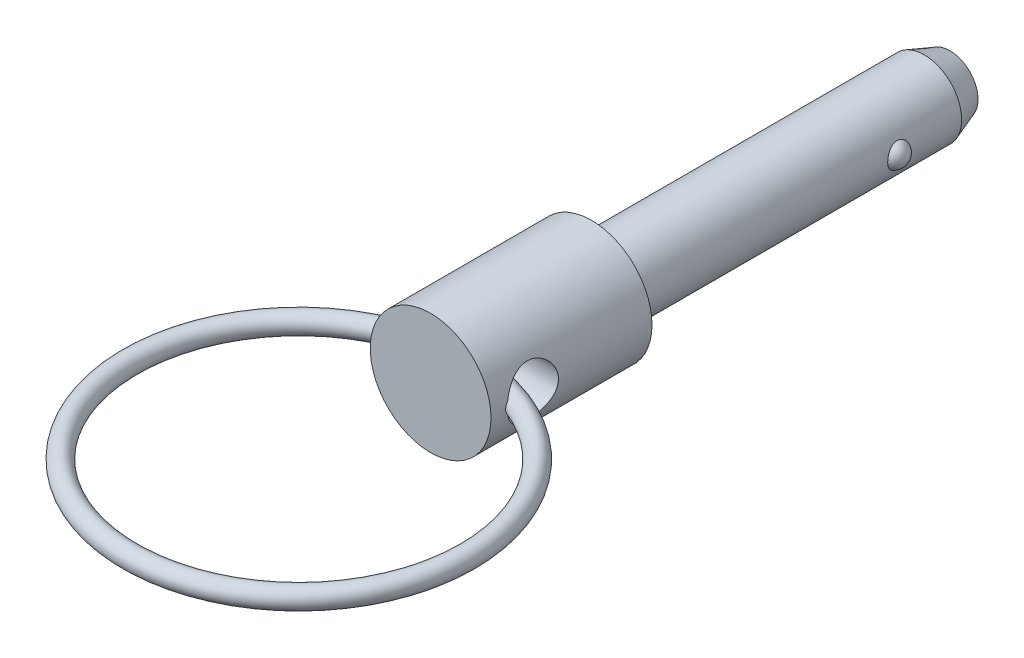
ISO-10303-21;
HEADER;
FILE_DESCRIPTION(('STEP AP214'),'2;1');
FILE_NAME('part.step','',(''),(''),'','','');
FILE_SCHEMA(('AUTOMOTIVE_DESIGN { 1 0 10303 214 1 1 1 1 }'));
ENDSEC;
DATA;
#1=APPLICATION_CONTEXT('core data for automotive mechanical design processes');
#2=APPLICATION_PROTOCOL_DEFINITION('international standard','automotive_design',2000,#1);
#3=PRODUCT_CONTEXT('',#1,'mechanical');
#4=PRODUCT('Part','Part','',(#3));
#5=PRODUCT_RELATED_PRODUCT_CATEGORY('part','',(#4));
#6=PRODUCT_DEFINITION_FORMATION('','',#4);
#7=PRODUCT_DEFINITION_CONTEXT('part definition',#1,'design');
#8=PRODUCT_DEFINITION('design','',#6,#7);
#9=PRODUCT_DEFINITION_SHAPE('','',#8);
#10=(LENGTH_UNIT() NAMED_UNIT(*) SI_UNIT(.MILLI.,.METRE.));
#11=(NAMED_UNIT(*) PLANE_ANGLE_UNIT() SI_UNIT($,.RADIAN.));
#12=(NAMED_UNIT(*) SI_UNIT($,.STERADIAN.) SOLID_ANGLE_UNIT());
#13=UNCERTAINTY_MEASURE_WITH_UNIT(LENGTH_MEASURE(1.E-05),#10,'distance_accuracy_value','');
#14=(GEOMETRIC_REPRESENTATION_CONTEXT(3) GLOBAL_UNCERTAINTY_ASSIGNED_CONTEXT((#13)) GLOBAL_UNIT_ASSIGNED_CONTEXT((#10,
#11,#12)) REPRESENTATION_CONTEXT('',''));
#15=CARTESIAN_POINT('',(0.,0.,0.));
#16=DIRECTION('',(0.,0.,1.));
#17=DIRECTION('',(1.,0.,0.));
#18=AXIS2_PLACEMENT_3D('',#15,#16,#17);
#19=CARTESIAN_POINT('',(6.35,0.,9.398));
#20=DIRECTION('',(-1.,0.,0.));
#21=DIRECTION('',(0.,0.,-1.));
#22=AXIS2_PLACEMENT_3D('',#19,#20,#21);
#23=CYLINDRICAL_SURFACE('',#22,2.0193);
#24=CARTESIAN_POINT('',(-4.76270000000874,0.498153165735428,11.3548893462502));
#25=CARTESIAN_POINT('',(-4.72833190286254,0.475048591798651,11.3607446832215));
#26=CARTESIAN_POINT('',(-4.69505034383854,0.44991978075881,11.3667299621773));
#27=CARTESIAN_POINT('',(-4.63192457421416,0.394832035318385,11.3785339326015));
#28=CARTESIAN_POINT('',(-4.60213511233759,0.364810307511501,11.3843491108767));
#29=CARTESIAN_POINT('',(-4.55535458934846,0.308281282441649,11.3937756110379));
#30=CARTESIAN_POINT('',(-4.53705372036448,0.282907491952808,11.3975656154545));
#31=CARTESIAN_POINT('',(-4.50470768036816,0.229597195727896,11.4043835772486));
#32=CARTESIAN_POINT('',(-4.49064226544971,0.201673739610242,11.4074151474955));
#33=CARTESIAN_POINT('',(-4.46975490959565,0.148629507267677,11.4119668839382));
#34=CARTESIAN_POINT('',(-4.46210314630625,0.123852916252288,11.413657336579));
#35=CARTESIAN_POINT('',(-4.45097170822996,0.0733134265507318,11.4161269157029));
#36=CARTESIAN_POINT('',(-4.44749221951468,0.0475504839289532,11.4169060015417));
#37=CARTESIAN_POINT('',(-4.44500621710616,-0.0042594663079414,11.4174619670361));
#38=CARTESIAN_POINT('',(-4.44600914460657,-0.0303069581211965,11.4172367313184));
#39=CARTESIAN_POINT('',(-4.45241947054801,-0.0818207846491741,11.4158064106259));
#40=CARTESIAN_POINT('',(-4.45782777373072,-0.107286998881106,11.414601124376));
#41=CARTESIAN_POINT('',(-4.47240849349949,-0.156294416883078,11.4113883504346));
#42=CARTESIAN_POINT('',(-4.48147591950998,-0.179868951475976,11.4094032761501));
#43=CARTESIAN_POINT('',(-4.50279050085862,-0.225454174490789,11.404805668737));
#44=CARTESIAN_POINT('',(-4.51503925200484,-0.247464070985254,11.4021928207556));
#45=CARTESIAN_POINT('',(-4.55011891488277,-0.302206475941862,11.394845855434));
#46=CARTESIAN_POINT('',(-4.57493397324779,-0.333621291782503,11.3897686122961));
#47=CARTESIAN_POINT('',(-4.62912866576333,-0.392111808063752,11.3790894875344));
#48=CARTESIAN_POINT('',(-4.65852008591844,-0.419175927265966,11.3734862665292));
#49=CARTESIAN_POINT('',(-4.71307862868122,-0.463335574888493,11.3635175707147));
#50=CARTESIAN_POINT('',(-4.73757440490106,-0.481267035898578,11.3591766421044));
#51=CARTESIAN_POINT('',(-4.76270000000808,-0.498153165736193,11.35488934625));
#52=B_SPLINE_CURVE_WITH_KNOTS('',3,(#24,#25,#26,#27,#28,#29,#30,#31,#32,#33,#34,#35,#36,#37,#38,
#39,#40,#41,#42,#43,#44,#45,#46,#47,#48,#49,#50,#51),.UNSPECIFIED.,.F.,.F.,(4,2,2,2,2,2,2,2,2,2,
2,2,2,4),(0.,0.125801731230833,0.253367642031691,0.347579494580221,0.441333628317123,
0.518959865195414,0.596589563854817,0.674382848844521,0.75219211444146,0.827911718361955,
0.903669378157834,1.02403641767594,1.14471874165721,1.23653238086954),.UNSPECIFIED.);
#53=CARTESIAN_POINT('',(-4.73813099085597,0.481166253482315,11.3591352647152));
#54=VERTEX_POINT('',#53);
#55=CARTESIAN_POINT('',(-4.73813099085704,-0.48116625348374,11.359135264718));
#56=VERTEX_POINT('',#55);
#57=EDGE_CURVE('E40',#54,#56,#52,.T.);
#58=ORIENTED_EDGE('',*,*,#57,.F.);
#59=CARTESIAN_POINT('',(-4.7625,0.,11.4173));
#60=CARTESIAN_POINT('',(-4.76249489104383,-0.108112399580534,11.4172937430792));
#61=CARTESIAN_POINT('',(-4.75878025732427,-0.216312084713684,11.4085747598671));
#62=CARTESIAN_POINT('',(-4.74429807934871,-0.429541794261,11.3740482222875));
#63=CARTESIAN_POINT('',(-4.73352107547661,-0.534567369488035,11.3482177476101));
#64=CARTESIAN_POINT('',(-4.70606638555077,-0.73815162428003,11.280597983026));
#65=CARTESIAN_POINT('',(-4.68940628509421,-0.836728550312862,11.238856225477));
#66=CARTESIAN_POINT('',(-4.65179514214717,-1.02541561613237,11.1408163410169));
#67=CARTESIAN_POINT('',(-4.63084399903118,-1.11552555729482,11.0845178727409));
#68=CARTESIAN_POINT('',(-4.58553515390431,-1.28946876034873,10.9559107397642));
#69=CARTESIAN_POINT('',(-4.5610635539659,-1.37280723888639,10.8829734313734));
#70=CARTESIAN_POINT('',(-4.51195602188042,-1.52649281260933,10.7244940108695));
#71=CARTESIAN_POINT('',(-4.48732001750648,-1.59683374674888,10.638945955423));
#72=CARTESIAN_POINT('',(-4.43925108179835,-1.7261116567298,10.4523438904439));
#73=CARTESIAN_POINT('',(-4.41594507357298,-1.78427664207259,10.3507188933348));
#74=CARTESIAN_POINT('',(-4.37499469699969,-1.88246618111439,10.1379969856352));
#75=CARTESIAN_POINT('',(-4.35734737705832,-1.92250019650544,10.0269050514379));
#76=CARTESIAN_POINT('',(-4.33095312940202,-1.98122376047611,9.80411364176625));
#77=CARTESIAN_POINT('',(-4.32180970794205,-2.0008697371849,9.69271508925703));
#78=CARTESIAN_POINT('',(-4.31232297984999,-2.02124136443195,9.46785625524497));
#79=CARTESIAN_POINT('',(-4.31197457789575,-2.02197796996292,9.35439720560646));
#80=CARTESIAN_POINT('',(-4.31978298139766,-2.00522830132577,9.13832342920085));
#81=CARTESIAN_POINT('',(-4.32726229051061,-1.98919366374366,9.03556669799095));
#82=CARTESIAN_POINT('',(-4.34873498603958,-1.94179810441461,8.83436976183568));
#83=CARTESIAN_POINT('',(-4.36272967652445,-1.91043411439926,8.73593042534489));
#84=CARTESIAN_POINT('',(-4.39597564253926,-1.83265370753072,8.54363008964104));
#85=CARTESIAN_POINT('',(-4.41533413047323,-1.7859262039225,8.44991428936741));
#86=CARTESIAN_POINT('',(-4.45710273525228,-1.67896759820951,8.27128429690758));
#87=CARTESIAN_POINT('',(-4.4795139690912,-1.61873154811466,8.1863733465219));
#88=CARTESIAN_POINT('',(-4.52725353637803,-1.48026834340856,8.0199216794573));
#89=CARTESIAN_POINT('',(-4.55266534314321,-1.40092677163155,7.93932933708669));
#90=CARTESIAN_POINT('',(-4.60189767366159,-1.22958667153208,7.79224755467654));
#91=CARTESIAN_POINT('',(-4.62571737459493,-1.13758167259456,7.72576536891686));
#92=CARTESIAN_POINT('',(-4.66982369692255,-0.940529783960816,7.6073238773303));
#93=CARTESIAN_POINT('',(-4.69000583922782,-0.835212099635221,7.55577397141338));
#94=CARTESIAN_POINT('',(-4.72372878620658,-0.61641653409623,7.47153070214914));
#95=CARTESIAN_POINT('',(-4.7372827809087,-0.502955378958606,7.43879986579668));
#96=CARTESIAN_POINT('',(-4.7519215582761,-0.323662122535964,7.40374908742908));
#97=CARTESIAN_POINT('',(-4.75587275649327,-0.259363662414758,7.39437239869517));
#98=CARTESIAN_POINT('',(-4.76116348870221,-0.130053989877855,7.3818460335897));
#99=CARTESIAN_POINT('',(-4.76250307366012,-0.0650427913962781,7.3786962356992));
#100=CARTESIAN_POINT('',(-4.76249489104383,0.108112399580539,7.37870625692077));
#101=CARTESIAN_POINT('',(-4.75878025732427,0.216312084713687,7.38742524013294));
#102=CARTESIAN_POINT('',(-4.74429807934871,0.429541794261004,7.42195177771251));
#103=CARTESIAN_POINT('',(-4.7335210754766,0.53456736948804,7.44778225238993));
#104=CARTESIAN_POINT('',(-4.70606638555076,0.738151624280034,7.51540201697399));
#105=CARTESIAN_POINT('',(-4.68940628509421,0.836728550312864,7.55714377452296));
#106=CARTESIAN_POINT('',(-4.65179514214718,1.02541561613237,7.65518365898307));
#107=CARTESIAN_POINT('',(-4.63084399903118,1.11552555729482,7.71148212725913));
#108=CARTESIAN_POINT('',(-4.58553515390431,1.28946876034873,7.84008926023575));
#109=CARTESIAN_POINT('',(-4.5610635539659,1.37280723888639,7.91302656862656));
#110=CARTESIAN_POINT('',(-4.51195602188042,1.52649281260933,8.0715059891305));
#111=CARTESIAN_POINT('',(-4.48732001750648,1.59683374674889,8.15705404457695));
#112=CARTESIAN_POINT('',(-4.43925108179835,1.7261116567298,8.3436561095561));
#113=CARTESIAN_POINT('',(-4.41594507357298,1.78427664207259,8.44528110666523));
#114=CARTESIAN_POINT('',(-4.37499469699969,1.88246618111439,8.65800301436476));
#115=CARTESIAN_POINT('',(-4.35734737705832,1.92250019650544,8.76909494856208));
#116=CARTESIAN_POINT('',(-4.33095312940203,1.98122376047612,8.99188635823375));
#117=CARTESIAN_POINT('',(-4.32180970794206,2.00086973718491,9.10328491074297));
#118=CARTESIAN_POINT('',(-4.31232297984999,2.02124136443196,9.32814374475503));
#119=CARTESIAN_POINT('',(-4.31197457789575,2.02197796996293,9.44160279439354));
#120=CARTESIAN_POINT('',(-4.31978298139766,2.00522830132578,9.65767657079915));
#121=CARTESIAN_POINT('',(-4.32726229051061,1.98919366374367,9.76043330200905));
#122=CARTESIAN_POINT('',(-4.34873498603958,1.94179810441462,9.96163023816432));
#123=CARTESIAN_POINT('',(-4.36272967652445,1.91043411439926,10.0600695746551));
#124=CARTESIAN_POINT('',(-4.39597564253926,1.83265370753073,10.252369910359));
#125=CARTESIAN_POINT('',(-4.41533413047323,1.78592620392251,10.3460857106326));
#126=CARTESIAN_POINT('',(-4.45710273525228,1.67896759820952,10.5247157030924));
#127=CARTESIAN_POINT('',(-4.4795139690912,1.61873154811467,10.6096266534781));
#128=CARTESIAN_POINT('',(-4.52725353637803,1.48026834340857,10.7760783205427));
#129=CARTESIAN_POINT('',(-4.55266534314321,1.40092677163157,10.8566706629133));
#130=CARTESIAN_POINT('',(-4.60189767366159,1.22958667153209,11.0037524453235));
#131=CARTESIAN_POINT('',(-4.62571737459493,1.13758167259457,11.0702346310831));
#132=CARTESIAN_POINT('',(-4.66982369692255,0.94052978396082,11.1886761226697));
#133=CARTESIAN_POINT('',(-4.69000583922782,0.835212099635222,11.2402260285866));
#134=CARTESIAN_POINT('',(-4.72372878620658,0.616416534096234,11.3244692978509));
#135=CARTESIAN_POINT('',(-4.7372827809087,0.502955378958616,11.3572001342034));
#136=CARTESIAN_POINT('',(-4.7519215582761,0.323662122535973,11.392250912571));
#137=CARTESIAN_POINT('',(-4.75587275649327,0.259363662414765,11.4016276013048));
#138=CARTESIAN_POINT('',(-4.76116348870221,0.13005398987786,11.4141539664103));
#139=CARTESIAN_POINT('',(-4.76250307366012,0.0650427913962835,11.4173037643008));
#140=CARTESIAN_POINT('',(-4.7625,0.,11.4173));
#141=B_SPLINE_CURVE_WITH_KNOTS('',3,(#59,#60,#61,#62,#63,#64,#65,#66,#67,#68,#69,#70,#71,#72,
#73,#74,#75,#76,#77,#78,#79,#80,#81,#82,#83,#84,#85,#86,#87,#88,#89,#90,#91,#92,#93,#94,#95,#96,
#97,#98,#99,#100,#101,#102,#103,#104,#105,#106,#107,#108,#109,#110,#111,#112,#113,#114,#115,
#116,#117,#118,#119,#120,#121,#122,#123,#124,#125,#126,#127,#128,#129,#130,#131,#132,#133,#134,
#135,#136,#137,#138,#139,#140),.UNSPECIFIED.,.T.,.F.,(4,2,2,2,2,2,2,2,2,2,2,2,2,2,2,2,2,2,2,2,2,
2,2,2,2,2,2,2,2,2,2,2,2,2,2,2,2,2,2,2,4),(0.,0.324084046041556,0.648603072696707,
0.972160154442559,1.29572482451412,1.63451297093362,1.97346129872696,2.32983137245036,
2.68601525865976,3.02460962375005,3.36300782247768,3.67436181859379,3.98577815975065,
4.30393445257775,4.6222074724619,4.96838833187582,5.31474674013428,5.66985671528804,
6.02425711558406,6.21923699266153,6.41421306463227,6.73829711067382,7.06281613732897,
7.38637321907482,7.70993788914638,8.04872603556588,8.38767436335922,8.74404443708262,
9.10022832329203,9.43882268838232,9.77722088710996,10.0885748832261,10.3999912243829,
10.71814751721,11.0364205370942,11.3826013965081,11.7289598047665,12.0840697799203,
12.4384701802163,12.6334500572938,12.8284261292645),.UNSPECIFIED.);
#142=EDGE_CURVE('E54',#56,#54,#141,.T.);
#143=ORIENTED_EDGE('',*,*,#142,.F.);
#144=EDGE_LOOP('',(#58,#143));
#145=FACE_BOUND('',#144,.T.);
#146=CARTESIAN_POINT('',(4.76270000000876,-0.498153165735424,11.3548893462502));
#147=CARTESIAN_POINT('',(4.72833190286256,-0.475048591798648,11.3607446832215));
#148=CARTESIAN_POINT('',(4.69505034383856,-0.449919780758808,11.3667299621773));
#149=CARTESIAN_POINT('',(4.63192457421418,-0.394832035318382,11.3785339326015));
#150=CARTESIAN_POINT('',(4.60213511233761,-0.364810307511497,11.3843491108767));
#151=CARTESIAN_POINT('',(4.55535458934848,-0.308281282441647,11.3937756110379));
#152=CARTESIAN_POINT('',(4.5370537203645,-0.282907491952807,11.3975656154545));
#153=CARTESIAN_POINT('',(4.50470768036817,-0.229597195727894,11.4043835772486));
#154=CARTESIAN_POINT('',(4.49064226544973,-0.201673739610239,11.4074151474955));
#155=CARTESIAN_POINT('',(4.46975490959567,-0.148629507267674,11.4119668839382));
#156=CARTESIAN_POINT('',(4.46210314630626,-0.123852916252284,11.413657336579));
#157=CARTESIAN_POINT('',(4.45097170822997,-0.0733134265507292,11.4161269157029));
#158=CARTESIAN_POINT('',(4.44749221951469,-0.0475504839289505,11.4169060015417));
#159=CARTESIAN_POINT('',(4.44500621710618,0.00425946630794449,11.4174619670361));
#160=CARTESIAN_POINT('',(4.44600914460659,0.0303069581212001,11.4172367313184));
#161=CARTESIAN_POINT('',(4.45241947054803,0.0818207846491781,11.4158064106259));
#162=CARTESIAN_POINT('',(4.45782777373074,0.10728699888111,11.414601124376));
#163=CARTESIAN_POINT('',(4.47240849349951,0.156294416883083,11.4113883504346));
#164=CARTESIAN_POINT('',(4.48147591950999,0.179868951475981,11.4094032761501));
#165=CARTESIAN_POINT('',(4.50279050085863,0.225454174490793,11.404805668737));
#166=CARTESIAN_POINT('',(4.51503925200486,0.247464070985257,11.4021928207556));
#167=CARTESIAN_POINT('',(4.55011891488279,0.302206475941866,11.394845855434));
#168=CARTESIAN_POINT('',(4.57493397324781,0.333621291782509,11.3897686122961));
#169=CARTESIAN_POINT('',(4.62912866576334,0.392111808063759,11.3790894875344));
#170=CARTESIAN_POINT('',(4.65852008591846,0.419175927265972,11.3734862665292));
#171=CARTESIAN_POINT('',(4.71307862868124,0.463335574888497,11.3635175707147));
#172=CARTESIAN_POINT('',(4.73757440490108,0.481267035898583,11.3591766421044));
#173=CARTESIAN_POINT('',(4.7627000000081,0.498153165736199,11.35488934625));
#174=B_SPLINE_CURVE_WITH_KNOTS('',3,(#146,#147,#148,#149,#150,#151,#152,#153,#154,#155,#156,
#157,#158,#159,#160,#161,#162,#163,#164,#165,#166,#167,#168,#169,#170,#171,#172,#173),
.UNSPECIFIED.,.F.,.F.,(4,2,2,2,2,2,2,2,2,2,2,2,2,4),(0.,0.125801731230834,0.25336764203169,
0.34757949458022,0.441333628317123,0.518959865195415,0.596589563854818,0.674382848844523,
0.752192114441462,0.827911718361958,0.903669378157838,1.02403641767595,1.14471874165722,
1.23653238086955),.UNSPECIFIED.);
#175=CARTESIAN_POINT('',(4.73813099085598,-0.481166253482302,11.3591352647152));
#176=VERTEX_POINT('',#175);
#177=CARTESIAN_POINT('',(4.73813099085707,0.481166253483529,11.359135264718));
#178=VERTEX_POINT('',#177);
#179=EDGE_CURVE('E33',#176,#178,#174,.T.);
#180=ORIENTED_EDGE('',*,*,#179,.F.);
#181=CARTESIAN_POINT('',(4.7625,0.,7.3787));
#182=CARTESIAN_POINT('',(4.76249489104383,-0.108112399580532,7.37870625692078));
#183=CARTESIAN_POINT('',(4.75878025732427,-0.21631208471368,7.38742524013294));
#184=CARTESIAN_POINT('',(4.74429807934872,-0.429541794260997,7.4219517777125));
#185=CARTESIAN_POINT('',(4.73352107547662,-0.534567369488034,7.44778225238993));
#186=CARTESIAN_POINT('',(4.70606638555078,-0.738151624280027,7.51540201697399));
#187=CARTESIAN_POINT('',(4.68940628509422,-0.836728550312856,7.55714377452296));
#188=CARTESIAN_POINT('',(4.65179514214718,-1.02541561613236,7.65518365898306));
#189=CARTESIAN_POINT('',(4.63084399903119,-1.11552555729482,7.71148212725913));
#190=CARTESIAN_POINT('',(4.58553515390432,-1.28946876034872,7.84008926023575));
#191=CARTESIAN_POINT('',(4.56106355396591,-1.37280723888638,7.91302656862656));
#192=CARTESIAN_POINT('',(4.51195602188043,-1.52649281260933,8.0715059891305));
#193=CARTESIAN_POINT('',(4.48732001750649,-1.59683374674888,8.15705404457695));
#194=CARTESIAN_POINT('',(4.43925108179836,-1.7261116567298,8.3436561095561));
#195=CARTESIAN_POINT('',(4.41594507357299,-1.78427664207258,8.44528110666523));
#196=CARTESIAN_POINT('',(4.3749946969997,-1.88246618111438,8.65800301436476));
#197=CARTESIAN_POINT('',(4.35734737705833,-1.92250019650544,8.76909494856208));
#198=CARTESIAN_POINT('',(4.33095312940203,-1.98122376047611,8.99188635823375));
#199=CARTESIAN_POINT('',(4.32180970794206,-2.0008697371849,9.10328491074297));
#200=CARTESIAN_POINT('',(4.31232297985,-2.02124136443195,9.32814374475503));
#201=CARTESIAN_POINT('',(4.31197457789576,-2.02197796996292,9.44160279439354));
#202=CARTESIAN_POINT('',(4.31978298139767,-2.00522830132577,9.65767657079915));
#203=CARTESIAN_POINT('',(4.32726229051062,-1.98919366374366,9.76043330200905));
#204=CARTESIAN_POINT('',(4.34873498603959,-1.94179810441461,9.96163023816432));
#205=CARTESIAN_POINT('',(4.36272967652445,-1.91043411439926,10.0600695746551));
#206=CARTESIAN_POINT('',(4.39597564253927,-1.83265370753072,10.252369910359));
#207=CARTESIAN_POINT('',(4.41533413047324,-1.7859262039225,10.3460857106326));
#208=CARTESIAN_POINT('',(4.45710273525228,-1.67896759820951,10.5247157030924));
#209=CARTESIAN_POINT('',(4.47951396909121,-1.61873154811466,10.6096266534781));
#210=CARTESIAN_POINT('',(4.52725353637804,-1.48026834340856,10.7760783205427));
#211=CARTESIAN_POINT('',(4.55266534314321,-1.40092677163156,10.8566706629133));
#212=CARTESIAN_POINT('',(4.60189767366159,-1.22958667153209,11.0037524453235));
#213=CARTESIAN_POINT('',(4.62571737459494,-1.13758167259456,11.0702346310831));
#214=CARTESIAN_POINT('',(4.66982369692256,-0.94052978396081,11.1886761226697));
#215=CARTESIAN_POINT('',(4.69000583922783,-0.835212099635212,11.2402260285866));
#216=CARTESIAN_POINT('',(4.72372878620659,-0.616416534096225,11.3244692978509));
#217=CARTESIAN_POINT('',(4.73728278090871,-0.502955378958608,11.3572001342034));
#218=CARTESIAN_POINT('',(4.75192155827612,-0.323662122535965,11.3922509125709));
#219=CARTESIAN_POINT('',(4.75587275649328,-0.259363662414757,11.4016276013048));
#220=CARTESIAN_POINT('',(4.76116348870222,-0.130053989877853,11.4141539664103));
#221=CARTESIAN_POINT('',(4.76250307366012,-0.0650427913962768,11.4173037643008));
#222=CARTESIAN_POINT('',(4.76249489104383,0.108112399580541,11.4172937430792));
#223=CARTESIAN_POINT('',(4.75878025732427,0.216312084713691,11.4085747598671));
#224=CARTESIAN_POINT('',(4.74429807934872,0.429541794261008,11.3740482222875));
#225=CARTESIAN_POINT('',(4.73352107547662,0.534567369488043,11.3482177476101));
#226=CARTESIAN_POINT('',(4.70606638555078,0.738151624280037,11.280597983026));
#227=CARTESIAN_POINT('',(4.68940628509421,0.83672855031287,11.238856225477));
#228=CARTESIAN_POINT('',(4.65179514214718,1.02541561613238,11.1408163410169));
#229=CARTESIAN_POINT('',(4.63084399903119,1.11552555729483,11.0845178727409));
#230=CARTESIAN_POINT('',(4.58553515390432,1.28946876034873,10.9559107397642));
#231=CARTESIAN_POINT('',(4.56106355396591,1.3728072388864,10.8829734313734));
#232=CARTESIAN_POINT('',(4.51195602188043,1.52649281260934,10.7244940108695));
#233=CARTESIAN_POINT('',(4.48732001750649,1.59683374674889,10.638945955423));
#234=CARTESIAN_POINT('',(4.43925108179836,1.7261116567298,10.4523438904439));
#235=CARTESIAN_POINT('',(4.41594507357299,1.78427664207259,10.3507188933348));
#236=CARTESIAN_POINT('',(4.37499469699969,1.8824661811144,10.1379969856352));
#237=CARTESIAN_POINT('',(4.35734737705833,1.92250019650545,10.0269050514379));
#238=CARTESIAN_POINT('',(4.33095312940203,1.98122376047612,9.80411364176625));
#239=CARTESIAN_POINT('',(4.32180970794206,2.00086973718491,9.69271508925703));
#240=CARTESIAN_POINT('',(4.31232297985,2.02124136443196,9.46785625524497));
#241=CARTESIAN_POINT('',(4.31197457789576,2.02197796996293,9.35439720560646));
#242=CARTESIAN_POINT('',(4.31978298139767,2.00522830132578,9.13832342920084));
#243=CARTESIAN_POINT('',(4.32726229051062,1.98919366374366,9.03556669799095));
#244=CARTESIAN_POINT('',(4.34873498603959,1.94179810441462,8.83436976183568));
#245=CARTESIAN_POINT('',(4.36272967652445,1.91043411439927,8.73593042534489));
#246=CARTESIAN_POINT('',(4.39597564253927,1.83265370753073,8.54363008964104));
#247=CARTESIAN_POINT('',(4.41533413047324,1.7859262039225,8.44991428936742));
#248=CARTESIAN_POINT('',(4.45710273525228,1.67896759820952,8.27128429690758));
#249=CARTESIAN_POINT('',(4.47951396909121,1.61873154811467,8.1863733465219));
#250=CARTESIAN_POINT('',(4.52725353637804,1.48026834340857,8.0199216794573));
#251=CARTESIAN_POINT('',(4.55266534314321,1.40092677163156,7.93932933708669));
#252=CARTESIAN_POINT('',(4.6018976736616,1.22958667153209,7.79224755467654));
#253=CARTESIAN_POINT('',(4.62571737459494,1.13758167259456,7.72576536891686));
#254=CARTESIAN_POINT('',(4.66982369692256,0.940529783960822,7.6073238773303));
#255=CARTESIAN_POINT('',(4.69000583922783,0.835212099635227,7.55577397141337));
#256=CARTESIAN_POINT('',(4.72372878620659,0.616416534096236,7.47153070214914));
#257=CARTESIAN_POINT('',(4.73728278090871,0.502955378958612,7.43879986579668));
#258=CARTESIAN_POINT('',(4.75192155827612,0.32366212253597,7.40374908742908));
#259=CARTESIAN_POINT('',(4.75587275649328,0.259363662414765,7.39437239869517));
#260=CARTESIAN_POINT('',(4.76116348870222,0.130053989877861,7.3818460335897));
#261=CARTESIAN_POINT('',(4.76250307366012,0.0650427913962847,7.3786962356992));
#262=CARTESIAN_POINT('',(4.7625,0.,7.3787));
#263=B_SPLINE_CURVE_WITH_KNOTS('',3,(#181,#182,#183,#184,#185,#186,#187,#188,#189,#190,#191,
#192,#193,#194,#195,#196,#197,#198,#199,#200,#201,#202,#203,#204,#205,#206,#207,#208,#209,#210,
#211,#212,#213,#214,#215,#216,#217,#218,#219,#220,#221,#222,#223,#224,#225,#226,#227,#228,#229,
#230,#231,#232,#233,#234,#235,#236,#237,#238,#239,#240,#241,#242,#243,#244,#245,#246,#247,#248,
#249,#250,#251,#252,#253,#254,#255,#256,#257,#258,#259,#260,#261,#262),.UNSPECIFIED.,.T.,.F.,(4,
2,2,2,2,2,2,2,2,2,2,2,2,2,2,2,2,2,2,2,2,2,2,2,2,2,2,2,2,2,2,2,2,2,2,2,2,2,2,2,4),(0.,
0.324084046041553,0.648603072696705,0.972160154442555,1.29572482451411,1.63451297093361,
1.97346129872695,2.32983137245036,2.68601525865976,3.02460962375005,3.36300782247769,
3.67436181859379,3.98577815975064,4.30393445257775,4.6222074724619,4.96838833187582,
5.31474674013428,5.66985671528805,6.02425711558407,6.21923699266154,6.41421306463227,
6.73829711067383,7.06281613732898,7.38637321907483,7.70993788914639,8.04872603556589,
8.38767436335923,8.74404443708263,9.10022832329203,9.43882268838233,9.77722088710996,
10.0885748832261,10.3999912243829,10.71814751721,11.0364205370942,11.3826013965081,
11.7289598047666,12.0840697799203,12.4384701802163,12.6334500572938,12.8284261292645),.UNSPECIFIED.);
#264=EDGE_CURVE('E50',#178,#176,#263,.T.);
#265=ORIENTED_EDGE('',*,*,#264,.F.);
#266=EDGE_LOOP('',(#180,#265));
#267=FACE_BOUND('',#266,.T.);
#268=ADVANCED_FACE('F14',(#145,#267),#23,.F.);
#269=CARTESIAN_POINT('',(0.,0.,-23.2664));
#270=DIRECTION('',(0.,0.,-1.));
#271=DIRECTION('',(1.,0.,0.));
#272=AXIS2_PLACEMENT_3D('',#269,#270,#271);
#273=CYLINDRICAL_SURFACE('',#272,4.7625);
#274=ORIENTED_EDGE('',*,*,#264,.T.);
#275=CARTESIAN_POINT('',(4.75672783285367,-0.234410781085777,9.86389096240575));
#276=CARTESIAN_POINT('',(4.75463715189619,-0.276823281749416,9.87695364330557));
#277=CARTESIAN_POINT('',(4.75202741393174,-0.318142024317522,9.89358560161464));
#278=CARTESIAN_POINT('',(4.74605906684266,-0.39738450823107,9.93354154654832));
#279=CARTESIAN_POINT('',(4.74269965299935,-0.435304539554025,9.95687273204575));
#280=CARTESIAN_POINT('',(4.7356117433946,-0.506628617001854,10.0095466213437));
#281=CARTESIAN_POINT('',(4.731883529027,-0.540036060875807,10.0388847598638));
#282=CARTESIAN_POINT('',(4.7244690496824,-0.601463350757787,10.1027270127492));
#283=CARTESIAN_POINT('',(4.7207827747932,-0.629484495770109,10.1372298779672));
#284=CARTESIAN_POINT('',(4.71381973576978,-0.679675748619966,10.2106969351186));
#285=CARTESIAN_POINT('',(4.71054647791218,-0.701797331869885,10.2496945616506));
#286=CARTESIAN_POINT('',(4.70478201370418,-0.739457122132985,10.3307970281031));
#287=CARTESIAN_POINT('',(4.70229092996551,-0.754994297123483,10.3729023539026));
#288=CARTESIAN_POINT('',(4.69825743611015,-0.779709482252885,10.4605198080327));
#289=CARTESIAN_POINT('',(4.69674995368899,-0.78865469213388,10.5060989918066));
#290=CARTESIAN_POINT('',(4.69494168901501,-0.799348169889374,10.5981124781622));
#291=CARTESIAN_POINT('',(4.69464124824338,-0.80109440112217,10.6445470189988));
#292=CARTESIAN_POINT('',(4.6952559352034,-0.797484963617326,10.7400273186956));
#293=CARTESIAN_POINT('',(4.69624797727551,-0.791679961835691,10.7890554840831));
#294=CARTESIAN_POINT('',(4.69943436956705,-0.772538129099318,10.88558205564));
#295=CARTESIAN_POINT('',(4.70162918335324,-0.759198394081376,10.9330798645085));
#296=CARTESIAN_POINT('',(4.70713666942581,-0.72429456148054,11.0283694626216));
#297=CARTESIAN_POINT('',(4.71051187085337,-0.702258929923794,11.0759856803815));
#298=CARTESIAN_POINT('',(4.71792781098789,-0.650571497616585,11.1668661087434));
#299=CARTESIAN_POINT('',(4.72196879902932,-0.620916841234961,11.2101286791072));
#300=CARTESIAN_POINT('',(4.73024120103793,-0.55439210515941,11.2909794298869));
#301=CARTESIAN_POINT('',(4.73447324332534,-0.517496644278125,11.3285468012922));
#302=CARTESIAN_POINT('',(4.74255290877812,-0.437280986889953,11.3961281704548));
#303=CARTESIAN_POINT('',(4.74640083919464,-0.393965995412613,11.4261482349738));
#304=CARTESIAN_POINT('',(4.75279848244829,-0.30664700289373,11.4743172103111));
#305=CARTESIAN_POINT('',(4.7554392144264,-0.263139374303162,11.4933494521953));
#306=CARTESIAN_POINT('',(4.75956072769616,-0.173210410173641,11.5225838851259));
#307=CARTESIAN_POINT('',(4.76104300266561,-0.126792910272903,11.5327974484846));
#308=CARTESIAN_POINT('',(4.7625121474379,-0.0392228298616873,11.5429046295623));
#309=CARTESIAN_POINT('',(4.76267454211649,0.00179015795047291,11.5440098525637));
#310=CARTESIAN_POINT('',(4.76194485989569,0.0833582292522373,11.5390051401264));
#311=CARTESIAN_POINT('',(4.76105302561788,0.123913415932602,11.5328968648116));
#312=CARTESIAN_POINT('',(4.75839052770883,0.201390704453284,11.5143023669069));
#313=CARTESIAN_POINT('',(4.7566647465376,0.238393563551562,11.5021410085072));
#314=CARTESIAN_POINT('',(4.75253498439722,0.310009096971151,11.4722173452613));
#315=CARTESIAN_POINT('',(4.75013086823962,0.344621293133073,11.4544539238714));
#316=CARTESIAN_POINT('',(4.74468244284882,0.413106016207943,11.4126354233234));
#317=CARTESIAN_POINT('',(4.74160529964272,0.446760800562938,11.3882294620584));
#318=CARTESIAN_POINT('',(4.73521429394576,0.510064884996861,11.3347169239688));
#319=CARTESIAN_POINT('',(4.73190032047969,0.539712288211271,11.3056081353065));
#320=CARTESIAN_POINT('',(4.72489226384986,0.59814174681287,11.2395451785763));
#321=CARTESIAN_POINT('',(4.72120374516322,0.626328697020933,11.2020637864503));
#322=CARTESIAN_POINT('',(4.71424234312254,0.67673773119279,11.1232450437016));
#323=CARTESIAN_POINT('',(4.71096968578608,0.698956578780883,11.0819056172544));
#324=CARTESIAN_POINT('',(4.70485086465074,0.739081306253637,10.9918449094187));
#325=CARTESIAN_POINT('',(4.70208579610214,0.756287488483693,10.9428045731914));
#326=CARTESIAN_POINT('',(4.69779376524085,0.782507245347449,10.8425158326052));
#327=CARTESIAN_POINT('',(4.69626707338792,0.791519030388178,10.7912669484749));
#328=CARTESIAN_POINT('',(4.69466144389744,0.80099052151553,10.6869325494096));
#329=CARTESIAN_POINT('',(4.69461132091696,0.801280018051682,10.6338307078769));
#330=CARTESIAN_POINT('',(4.69610058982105,0.792506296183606,10.5284214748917));
#331=CARTESIAN_POINT('',(4.69763938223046,0.783446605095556,10.4761137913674));
#332=CARTESIAN_POINT('',(4.70202301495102,0.756674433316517,10.3770218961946));
#333=CARTESIAN_POINT('',(4.70478816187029,0.739486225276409,10.3300928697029));
#334=CARTESIAN_POINT('',(4.7112739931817,0.696967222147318,10.2401511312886));
#335=CARTESIAN_POINT('',(4.7149942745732,0.671639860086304,10.1971367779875));
#336=CARTESIAN_POINT('',(4.72264431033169,0.615452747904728,10.1192841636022));
#337=CARTESIAN_POINT('',(4.7265430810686,0.585080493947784,10.0840903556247));
#338=CARTESIAN_POINT('',(4.73429341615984,0.51863947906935,10.0195645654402));
#339=CARTESIAN_POINT('',(4.73814499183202,0.48257211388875,9.99023115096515));
#340=CARTESIAN_POINT('',(4.74520575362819,0.407195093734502,9.93927752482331));
#341=CARTESIAN_POINT('',(4.74843306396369,0.368048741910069,9.91741780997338));
#342=CARTESIAN_POINT('',(4.75404590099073,0.286564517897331,9.88060848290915));
#343=CARTESIAN_POINT('',(4.75643129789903,0.244226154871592,9.86565993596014));
#344=CARTESIAN_POINT('',(4.76007108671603,0.158026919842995,9.84320151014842));
#345=CARTESIAN_POINT('',(4.7613364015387,0.114185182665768,9.8356197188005));
#346=CARTESIAN_POINT('',(4.76263391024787,0.025866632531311,9.82784590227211));
#347=CARTESIAN_POINT('',(4.76266746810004,-0.0186094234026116,9.82764570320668));
#348=CARTESIAN_POINT('',(4.76170334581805,-0.0918724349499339,9.83342133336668));
#349=CARTESIAN_POINT('',(4.76105293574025,-0.120844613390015,9.83731729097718));
#350=CARTESIAN_POINT('',(4.75925240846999,-0.178172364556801,9.84825826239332));
#351=CARTESIAN_POINT('',(4.75810228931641,-0.206527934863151,9.85530328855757));
#352=CARTESIAN_POINT('',(4.75672783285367,-0.234410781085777,9.86389096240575));
#353=B_SPLINE_CURVE_WITH_KNOTS('',3,(#275,#276,#277,#278,#279,#280,#281,#282,#283,#284,#285,
#286,#287,#288,#289,#290,#291,#292,#293,#294,#295,#296,#297,#298,#299,#300,#301,#302,#303,#304,
#305,#306,#307,#308,#309,#310,#311,#312,#313,#314,#315,#316,#317,#318,#319,#320,#321,#322,#323,
#324,#325,#326,#327,#328,#329,#330,#331,#332,#333,#334,#335,#336,#337,#338,#339,#340,#341,#342,
#343,#344,#345,#346,#347,#348,#349,#350,#351,#352),.UNSPECIFIED.,.T.,.F.,(4,2,2,2,2,2,2,2,2,2,2,
2,2,2,2,2,2,2,2,2,2,2,2,2,2,2,2,2,2,2,2,2,2,2,2,2,2,2,4),(0.,0.133176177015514,
0.266496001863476,0.399714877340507,0.532901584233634,0.667152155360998,0.801423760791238,
0.940235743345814,1.07908699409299,1.2265907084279,1.37415131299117,1.53115159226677,
1.68821080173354,1.84583071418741,2.00332351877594,2.14516294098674,2.28681917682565,
2.40926643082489,2.53168551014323,2.64814679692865,2.76463131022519,2.88919364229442,
3.01381473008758,3.15436663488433,3.29499460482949,3.45041783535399,3.60587500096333,
3.76436388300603,3.92279299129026,4.07216500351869,4.22147409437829,4.36072714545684,
4.49994612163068,4.63415709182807,4.76838874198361,4.90129648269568,5.03405704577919,
5.12160944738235,5.20916219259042),.UNSPECIFIED.);
#354=EDGE_CURVE('E27',#176,#178,#353,.T.);
#355=ORIENTED_EDGE('',*,*,#354,.T.);
#356=EDGE_LOOP('',(#274,#355));
#357=FACE_BOUND('',#356,.T.);
#358=CARTESIAN_POINT('',(0.,0.,1.13485609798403E-11));
#359=DIRECTION('',(0.,0.,-1.));
#360=DIRECTION('',(1.,0.,0.));
#361=AXIS2_PLACEMENT_3D('',#358,#359,#360);
#362=CIRCLE('',#361,4.76249999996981);
#363=CARTESIAN_POINT('',(4.76249999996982,0.,1.13483510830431E-11));
#364=VERTEX_POINT('',#363);
#365=EDGE_CURVE('E59',#364,#364,#362,.T.);
#366=ORIENTED_EDGE('',*,*,#365,.F.);
#367=EDGE_LOOP('',(#366));
#368=FACE_BOUND('',#367,.T.);
#369=CARTESIAN_POINT('',(0.,0.,12.7000000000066));
#370=DIRECTION('',(0.,0.,-1.));
#371=DIRECTION('',(1.,0.,0.));
#372=AXIS2_PLACEMENT_3D('',#369,#370,#371);
#373=CIRCLE('',#372,4.76249999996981);
#374=CARTESIAN_POINT('',(4.76249999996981,0.,12.7000000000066));
#375=VERTEX_POINT('',#374);
#376=EDGE_CURVE('E135',#375,#375,#373,.T.);
#377=ORIENTED_EDGE('',*,*,#376,.T.);
#378=EDGE_LOOP('',(#377));
#379=FACE_BOUND('',#378,.T.);
#380=ORIENTED_EDGE('',*,*,#142,.T.);
#381=CARTESIAN_POINT('',(-4.75672783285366,-0.234410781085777,9.86389096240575));
#382=CARTESIAN_POINT('',(-4.75880797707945,-0.192184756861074,9.85088943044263));
#383=CARTESIAN_POINT('',(-4.76037619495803,-0.148820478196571,9.84140883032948));
#384=CARTESIAN_POINT('',(-4.76231114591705,-0.0610623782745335,9.8297605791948));
#385=CARTESIAN_POINT('',(-4.76267662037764,-0.0166675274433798,9.82760058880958));
#386=CARTESIAN_POINT('',(-4.76216356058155,0.0718447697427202,9.83066350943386));
#387=CARTESIAN_POINT('',(-4.76128553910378,0.115962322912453,9.83588337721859));
#388=CARTESIAN_POINT('',(-4.75838343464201,0.20267168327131,9.85356395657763));
#389=CARTESIAN_POINT('',(-4.75635960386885,0.245263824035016,9.86602307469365));
#390=CARTESIAN_POINT('',(-4.75138989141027,0.327732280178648,9.89785096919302));
#391=CARTESIAN_POINT('',(-4.74844388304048,0.367608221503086,9.91722069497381));
#392=CARTESIAN_POINT('',(-4.74195662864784,0.443516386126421,9.96233891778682));
#393=CARTESIAN_POINT('',(-4.73841538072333,0.479548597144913,9.98808743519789));
#394=CARTESIAN_POINT('',(-4.73111995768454,0.546865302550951,10.0453065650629));
#395=CARTESIAN_POINT('',(-4.72736528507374,0.578138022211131,10.0767909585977));
#396=CARTESIAN_POINT('',(-4.72006096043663,0.635024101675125,10.1445276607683));
#397=CARTESIAN_POINT('',(-4.71651131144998,0.660637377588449,10.1807800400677));
#398=CARTESIAN_POINT('',(-4.70994476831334,0.705946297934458,10.2575433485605));
#399=CARTESIAN_POINT('',(-4.70693606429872,0.725553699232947,10.298106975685));
#400=CARTESIAN_POINT('',(-4.70181675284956,0.758021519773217,10.3818966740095));
#401=CARTESIAN_POINT('',(-4.69970628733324,0.770880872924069,10.4251231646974));
#402=CARTESIAN_POINT('',(-4.696508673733,0.790134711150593,10.5148288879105));
#403=CARTESIAN_POINT('',(-4.69546563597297,0.796251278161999,10.5613691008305));
#404=CARTESIAN_POINT('',(-4.69462220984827,0.801207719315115,10.6548424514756));
#405=CARTESIAN_POINT('',(-4.69482220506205,0.800045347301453,10.7017757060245));
#406=CARTESIAN_POINT('',(-4.69645733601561,0.790392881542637,10.7979976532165));
#407=CARTESIAN_POINT('',(-4.69797327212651,0.781423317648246,10.8472368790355));
#408=CARTESIAN_POINT('',(-4.7021466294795,0.755902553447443,10.943667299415));
#409=CARTESIAN_POINT('',(-4.70480451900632,0.739348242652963,10.9908576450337));
#410=CARTESIAN_POINT('',(-4.71113533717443,0.697907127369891,11.0846488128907));
#411=CARTESIAN_POINT('',(-4.71485784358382,0.672595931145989,11.1310597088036));
#412=CARTESIAN_POINT('',(-4.72278864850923,0.614436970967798,11.2188860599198));
#413=CARTESIAN_POINT('',(-4.72699707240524,0.581587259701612,11.2603002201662));
#414=CARTESIAN_POINT('',(-4.73530162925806,0.509526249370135,11.3359421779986));
#415=CARTESIAN_POINT('',(-4.73939847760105,0.47042640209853,11.3702753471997));
#416=CARTESIAN_POINT('',(-4.74699023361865,0.386343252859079,11.4308675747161));
#417=CARTESIAN_POINT('',(-4.75048579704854,0.341366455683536,11.4571354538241));
#418=CARTESIAN_POINT('',(-4.75599223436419,0.25237648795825,11.4974010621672));
#419=CARTESIAN_POINT('',(-4.75812829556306,0.208856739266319,11.5124686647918));
#420=CARTESIAN_POINT('',(-4.76120337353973,0.119700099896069,11.5339491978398));
#421=CARTESIAN_POINT('',(-4.76214369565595,0.0740655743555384,11.540371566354));
#422=CARTESIAN_POINT('',(-4.76265411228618,-0.0117455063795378,11.54386707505));
#423=CARTESIAN_POINT('',(-4.76238280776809,-0.051880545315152,11.5420222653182));
#424=CARTESIAN_POINT('',(-4.76085712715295,-0.13122090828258,11.531508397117));
#425=CARTESIAN_POINT('',(-4.75960284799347,-0.170426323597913,11.5228400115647));
#426=CARTESIAN_POINT('',(-4.75629335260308,-0.245921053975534,11.499439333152));
#427=CARTESIAN_POINT('',(-4.75425749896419,-0.282257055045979,11.4848531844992));
#428=CARTESIAN_POINT('',(-4.74958711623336,-0.352221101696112,11.4503009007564));
#429=CARTESIAN_POINT('',(-4.74695243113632,-0.385848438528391,11.4303333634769));
#430=CARTESIAN_POINT('',(-4.74107206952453,-0.45261689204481,11.3838151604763));
#431=CARTESIAN_POINT('',(-4.73779315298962,-0.485460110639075,11.3568423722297));
#432=CARTESIAN_POINT('',(-4.73110830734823,-0.546785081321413,11.2983457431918));
#433=CARTESIAN_POINT('',(-4.72770231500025,-0.575264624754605,11.2668196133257));
#434=CARTESIAN_POINT('',(-4.72061927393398,-0.630909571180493,11.1957249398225));
#435=CARTESIAN_POINT('',(-4.71696449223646,-0.657423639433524,11.1556436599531));
#436=CARTESIAN_POINT('',(-4.71023234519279,-0.704040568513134,11.071860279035));
#437=CARTESIAN_POINT('',(-4.70715528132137,-0.724140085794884,11.0281563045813));
#438=CARTESIAN_POINT('',(-4.7016537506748,-0.759079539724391,10.9340419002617));
#439=CARTESIAN_POINT('',(-4.69931471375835,-0.773270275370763,10.8833836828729));
#440=CARTESIAN_POINT('',(-4.69601325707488,-0.793074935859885,10.7803615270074));
#441=CARTESIAN_POINT('',(-4.69505096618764,-0.798688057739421,10.7279974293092));
#442=CARTESIAN_POINT('',(-4.69467378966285,-0.800903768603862,10.6230225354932));
#443=CARTESIAN_POINT('',(-4.69525980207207,-0.797501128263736,10.5704116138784));
#444=CARTESIAN_POINT('',(-4.69796643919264,-0.781399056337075,10.4666696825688));
#445=CARTESIAN_POINT('',(-4.70008633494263,-0.768704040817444,10.4155379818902));
#446=CARTESIAN_POINT('',(-4.70543825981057,-0.735202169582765,10.3197920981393));
#447=CARTESIAN_POINT('',(-4.70858907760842,-0.714975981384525,10.2749703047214));
#448=CARTESIAN_POINT('',(-4.71564813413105,-0.666826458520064,10.189721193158));
#449=CARTESIAN_POINT('',(-4.71955625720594,-0.638904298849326,10.1492932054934));
#450=CARTESIAN_POINT('',(-4.7273772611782,-0.578090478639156,10.0766022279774));
#451=CARTESIAN_POINT('',(-4.7312747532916,-0.545615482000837,10.0439879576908));
#452=CARTESIAN_POINT('',(-4.73883375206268,-0.475496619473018,9.98491901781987));
#453=CARTESIAN_POINT('',(-4.74249555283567,-0.437859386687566,9.95845655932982));
#454=CARTESIAN_POINT('',(-4.74798881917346,-0.372400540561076,9.92049627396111));
#455=CARTESIAN_POINT('',(-4.75001326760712,-0.345732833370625,9.90699794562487));
#456=CARTESIAN_POINT('',(-4.75367917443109,-0.291020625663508,9.88309301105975));
#457=CARTESIAN_POINT('',(-4.75532064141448,-0.262976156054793,9.87268633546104));
#458=CARTESIAN_POINT('',(-4.75672783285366,-0.234410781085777,9.86389096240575));
#459=B_SPLINE_CURVE_WITH_KNOTS('',3,(#381,#382,#383,#384,#385,#386,#387,#388,#389,#390,#391,
#392,#393,#394,#395,#396,#397,#398,#399,#400,#401,#402,#403,#404,#405,#406,#407,#408,#409,#410,
#411,#412,#413,#414,#415,#416,#417,#418,#419,#420,#421,#422,#423,#424,#425,#426,#427,#428,#429,
#430,#431,#432,#433,#434,#435,#436,#437,#438,#439,#440,#441,#442,#443,#444,#445,#446,#447,#448,
#449,#450,#451,#452,#453,#454,#455,#456,#457,#458),.UNSPECIFIED.,.T.,.F.,(4,2,2,2,2,2,2,2,2,2,2,
2,2,2,2,2,2,2,2,2,2,2,2,2,2,2,2,2,2,2,2,2,2,2,2,2,2,2,4),(0.,0.132584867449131,
0.265308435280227,0.397977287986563,0.530616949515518,0.663274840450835,0.795933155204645,
0.928914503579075,1.06189782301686,1.1967504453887,1.33162436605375,1.47187070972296,
1.6121603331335,1.76172674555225,1.91135454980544,2.06958609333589,2.22785855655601,
2.38357184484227,2.53911422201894,2.67661376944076,2.81396308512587,2.933899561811,
3.05382421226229,3.17095185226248,3.28811004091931,3.41548078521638,3.54291578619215,
3.68690552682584,3.83097019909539,3.98821148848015,4.14546749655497,4.30281473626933,
4.46008724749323,4.60714088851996,4.75417209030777,4.89206605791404,5.02978447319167,
5.11947848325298,5.20917048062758),.UNSPECIFIED.);
#460=EDGE_CURVE('E9',#54,#56,#459,.T.);
#461=ORIENTED_EDGE('',*,*,#460,.T.);
#462=EDGE_LOOP('',(#380,#461));
#463=FACE_BOUND('',#462,.T.);
#464=ADVANCED_FACE('F52',(#357,#368,#379,#463),#273,.T.);
#465=CARTESIAN_POINT('',(0.,0.,-5.));
#466=DIRECTION('',(0.,0.,1.));
#467=DIRECTION('',(-0.810321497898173,-0.585985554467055,0.));
#468=AXIS2_PLACEMENT_3D('',#465,#466,#467);
#469=CYLINDRICAL_SURFACE('',#468,2.95529);
#470=CARTESIAN_POINT('',(0.,0.,0.));
#471=DIRECTION('',(0.,0.,-1.));
#472=DIRECTION('',(0.810321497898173,0.585985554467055,0.));
#473=AXIS2_PLACEMENT_3D('',#470,#471,#472);
#474=CIRCLE('',#473,2.95529);
#475=CARTESIAN_POINT('',(2.39473501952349,1.73175724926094,0.));
#476=VERTEX_POINT('',#475);
#477=EDGE_CURVE('E48',#476,#476,#474,.T.);
#478=ORIENTED_EDGE('',*,*,#477,.T.);
#479=EDGE_LOOP('',(#478));
#480=FACE_BOUND('',#479,.T.);
#481=CARTESIAN_POINT('',(-2.95529,0.,-22.1918269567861));
#482=CARTESIAN_POINT('',(-2.95528983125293,0.0550926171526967,-22.1918267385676));
#483=CARTESIAN_POINT('',(-2.9537360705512,0.110186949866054,-22.1874652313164));
#484=CARTESIAN_POINT('',(-2.94767937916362,0.218829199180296,-22.170085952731));
#485=CARTESIAN_POINT('',(-2.94317634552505,0.272377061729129,-22.1570678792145));
#486=CARTESIAN_POINT('',(-2.93168588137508,0.376429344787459,-22.1225739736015));
#487=CARTESIAN_POINT('',(-2.92469717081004,0.426932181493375,-22.1010937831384));
#488=CARTESIAN_POINT('',(-2.90898593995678,0.523382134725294,-22.0500375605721));
#489=CARTESIAN_POINT('',(-2.90026339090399,0.569329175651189,-22.0204613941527));
#490=CARTESIAN_POINT('',(-2.88219034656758,0.654674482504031,-21.9542064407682));
#491=CARTESIAN_POINT('',(-2.87284943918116,0.6941498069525,-21.9176245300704));
#492=CARTESIAN_POINT('',(-2.8545494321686,0.76593858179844,-21.8379086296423));
#493=CARTESIAN_POINT('',(-2.84559022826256,0.798253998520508,-21.7947764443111));
#494=CARTESIAN_POINT('',(-2.82961358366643,0.853114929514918,-21.7053619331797));
#495=CARTESIAN_POINT('',(-2.82252187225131,0.876065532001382,-21.6593419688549));
#496=CARTESIAN_POINT('',(-2.81062752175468,0.913510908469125,-21.5637072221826));
#497=CARTESIAN_POINT('',(-2.80582362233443,0.928010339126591,-21.5140944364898));
#498=CARTESIAN_POINT('',(-2.79938954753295,0.947234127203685,-21.4165034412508));
#499=CARTESIAN_POINT('',(-2.79755758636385,0.952581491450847,-21.3686607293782));
#500=CARTESIAN_POINT('',(-2.79664698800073,0.955252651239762,-21.2727309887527));
#501=CARTESIAN_POINT('',(-2.79756762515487,0.952578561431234,-21.2246440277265));
#502=CARTESIAN_POINT('',(-2.8019574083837,0.939583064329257,-21.1316029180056));
#503=CARTESIAN_POINT('',(-2.8053237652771,0.92956995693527,-21.086600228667));
#504=CARTESIAN_POINT('',(-2.81411497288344,0.902604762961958,-20.9989431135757));
#505=CARTESIAN_POINT('',(-2.81953996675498,0.885652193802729,-20.9562888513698));
#506=CARTESIAN_POINT('',(-2.83202715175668,0.844881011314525,-20.8733947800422));
#507=CARTESIAN_POINT('',(-2.83912488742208,0.82091011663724,-20.8332354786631));
#508=CARTESIAN_POINT('',(-2.85415971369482,0.767002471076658,-20.7573259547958));
#509=CARTESIAN_POINT('',(-2.86209702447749,0.737064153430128,-20.7215768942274));
#510=CARTESIAN_POINT('',(-2.8785764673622,0.669928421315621,-20.6530007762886));
#511=CARTESIAN_POINT('',(-2.8871245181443,0.632386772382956,-20.6205121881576));
#512=CARTESIAN_POINT('',(-2.90347009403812,0.552505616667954,-20.5618624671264));
#513=CARTESIAN_POINT('',(-2.91126739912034,0.510164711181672,-20.5357031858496));
#514=CARTESIAN_POINT('',(-2.92581141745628,0.419068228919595,-20.4887292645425));
#515=CARTESIAN_POINT('',(-2.93246494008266,0.370078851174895,-20.4683383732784));
#516=CARTESIAN_POINT('',(-2.94343457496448,0.269265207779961,-20.4354688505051));
#517=CARTESIAN_POINT('',(-2.94775026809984,0.217440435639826,-20.4229916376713));
#518=CARTESIAN_POINT('',(-2.95371459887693,0.110692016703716,-20.4058753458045));
#519=CARTESIAN_POINT('',(-2.95527581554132,0.0557221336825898,-20.4014929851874));
#520=CARTESIAN_POINT('',(-2.95530399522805,-0.0542264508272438,-20.4014136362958));
#521=CARTESIAN_POINT('',(-2.95377072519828,-0.109205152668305,-20.4057173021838));
#522=CARTESIAN_POINT('',(-2.94774315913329,-0.218040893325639,-20.4230090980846));
#523=CARTESIAN_POINT('',(-2.94322672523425,-0.271886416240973,-20.4360621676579));
#524=CARTESIAN_POINT('',(-2.93168430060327,-0.376477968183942,-20.4707094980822));
#525=CARTESIAN_POINT('',(-2.92465821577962,-0.427223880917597,-20.4923040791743));
#526=CARTESIAN_POINT('',(-2.90890921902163,-0.523800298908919,-20.5435004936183));
#527=CARTESIAN_POINT('',(-2.90019735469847,-0.569659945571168,-20.5730506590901));
#528=CARTESIAN_POINT('',(-2.88203224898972,-0.655401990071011,-20.6396632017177));
#529=CARTESIAN_POINT('',(-2.87257908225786,-0.695284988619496,-20.6767248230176));
#530=CARTESIAN_POINT('',(-2.85437009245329,-0.766566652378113,-20.7562615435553));
#531=CARTESIAN_POINT('',(-2.84560167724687,-0.798193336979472,-20.7985289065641));
#532=CARTESIAN_POINT('',(-2.82953382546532,-0.853409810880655,-20.8882771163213));
#533=CARTESIAN_POINT('',(-2.82223368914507,-0.877003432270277,-20.9357554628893));
#534=CARTESIAN_POINT('',(-2.81047926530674,-0.913946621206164,-21.0312649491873));
#535=CARTESIAN_POINT('',(-2.80587004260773,-0.927865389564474,-21.0790567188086));
#536=CARTESIAN_POINT('',(-2.79937177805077,-0.947293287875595,-21.1764945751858));
#537=CARTESIAN_POINT('',(-2.79748150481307,-0.95280622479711,-21.2261398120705));
#538=CARTESIAN_POINT('',(-2.79669000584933,-0.955124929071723,-21.3225397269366));
#539=CARTESIAN_POINT('',(-2.79760942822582,-0.952453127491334,-21.369281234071));
#540=CARTESIAN_POINT('',(-2.80194263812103,-0.939628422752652,-21.4616015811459));
#541=CARTESIAN_POINT('',(-2.8053562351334,-0.929476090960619,-21.5071805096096));
#542=CARTESIAN_POINT('',(-2.81425442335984,-0.902171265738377,-21.5955474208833));
#543=CARTESIAN_POINT('',(-2.81972167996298,-0.88507727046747,-21.6383553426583));
#544=CARTESIAN_POINT('',(-2.83215289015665,-0.844451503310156,-21.7205558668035));
#545=CARTESIAN_POINT('',(-2.83911711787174,-0.820918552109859,-21.7599478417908));
#546=CARTESIAN_POINT('',(-2.85422317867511,-0.766794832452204,-21.836333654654));
#547=CARTESIAN_POINT('',(-2.86240622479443,-0.735912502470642,-21.8731124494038));
#548=CARTESIAN_POINT('',(-2.87884865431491,-0.668704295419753,-21.9412804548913));
#549=CARTESIAN_POINT('',(-2.88710805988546,-0.632376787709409,-21.9726680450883));
#550=CARTESIAN_POINT('',(-2.90347190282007,-0.552590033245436,-22.0314661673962));
#551=CARTESIAN_POINT('',(-2.91152747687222,-0.508813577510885,-22.0584602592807));
#552=CARTESIAN_POINT('',(-2.92604240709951,-0.417325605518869,-22.1052503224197));
#553=CARTESIAN_POINT('',(-2.93250136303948,-0.369613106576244,-22.1250444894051));
#554=CARTESIAN_POINT('',(-2.94346621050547,-0.269109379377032,-22.1579124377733));
#555=CARTESIAN_POINT('',(-2.94786226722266,-0.216184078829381,-22.1706139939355));
#556=CARTESIAN_POINT('',(-2.95377440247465,-0.108839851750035,-22.1875718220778));
#557=CARTESIAN_POINT('',(-2.9552901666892,-0.0544207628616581,-22.1918271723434));
#558=CARTESIAN_POINT('',(-2.95529,0.,-22.1918269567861));
#559=B_SPLINE_CURVE_WITH_KNOTS('',3,(#481,#482,#483,#484,#485,#486,#487,#488,#489,#490,#491,
#492,#493,#494,#495,#496,#497,#498,#499,#500,#501,#502,#503,#504,#505,#506,#507,#508,#509,#510,
#511,#512,#513,#514,#515,#516,#517,#518,#519,#520,#521,#522,#523,#524,#525,#526,#527,#528,#529,
#530,#531,#532,#533,#534,#535,#536,#537,#538,#539,#540,#541,#542,#543,#544,#545,#546,#547,#548,
#549,#550,#551,#552,#553,#554,#555,#556,#557,#558),.UNSPECIFIED.,.T.,.F.,(4,2,2,2,2,2,2,2,2,2,2,
2,2,2,2,2,2,2,2,2,2,2,2,2,2,2,2,2,2,2,2,2,2,2,2,2,2,2,4),(0.,0.165087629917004,
0.330181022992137,0.495359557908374,0.660540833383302,0.823584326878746,0.986582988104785,
1.14149686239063,1.2963252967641,1.44011939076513,1.58387558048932,1.72191574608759,
1.85996551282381,2.00126607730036,2.14260378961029,2.29308168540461,2.44360355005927,
2.60331407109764,2.76305321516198,2.92777664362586,3.09251247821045,3.25848475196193,
3.4244632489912,3.58938876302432,3.75429768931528,3.91400268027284,4.07363137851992,
4.22281693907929,4.37193491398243,4.51173733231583,4.65152907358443,4.79016644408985,
4.92882922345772,5.07435173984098,5.21991792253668,5.37539785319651,5.53091671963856,
5.69397331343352,5.85704770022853),.UNSPECIFIED.);
#560=CARTESIAN_POINT('',(-2.95529,0.,-22.1918269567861));
#561=VERTEX_POINT('',#560);
#562=EDGE_CURVE('E127',#561,#561,#559,.T.);
#563=ORIENTED_EDGE('',*,*,#562,.T.);
#564=EDGE_LOOP('',(#563));
#565=FACE_BOUND('',#564,.T.);
#566=CARTESIAN_POINT('',(0.,0.,-26.2344));
#567=DIRECTION('',(0.,0.,-1.));
#568=DIRECTION('',(1.,0.,0.));
#569=AXIS2_PLACEMENT_3D('',#566,#567,#568);
#570=CIRCLE('',#569,2.95529);
#571=CARTESIAN_POINT('',(2.95529000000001,0.,-26.2344));
#572=VERTEX_POINT('',#571);
#573=EDGE_CURVE('E132',#572,#572,#570,.F.);
#574=ORIENTED_EDGE('',*,*,#573,.T.);
#575=EDGE_LOOP('',(#574));
#576=FACE_BOUND('',#575,.T.);
#577=CARTESIAN_POINT('',(2.95529,0.,-22.1918269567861));
#578=CARTESIAN_POINT('',(2.95528983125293,-0.0550926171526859,-22.1918267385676));
#579=CARTESIAN_POINT('',(2.95373607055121,-0.110186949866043,-22.1874652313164));
#580=CARTESIAN_POINT('',(2.94767937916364,-0.218829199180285,-22.170085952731));
#581=CARTESIAN_POINT('',(2.94317634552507,-0.272377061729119,-22.1570678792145));
#582=CARTESIAN_POINT('',(2.93168588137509,-0.376429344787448,-22.1225739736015));
#583=CARTESIAN_POINT('',(2.92469717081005,-0.426932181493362,-22.1010937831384));
#584=CARTESIAN_POINT('',(2.90898593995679,-0.523382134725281,-22.0500375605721));
#585=CARTESIAN_POINT('',(2.90026339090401,-0.569329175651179,-22.0204613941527));
#586=CARTESIAN_POINT('',(2.8821903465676,-0.65467448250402,-21.9542064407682));
#587=CARTESIAN_POINT('',(2.87284943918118,-0.694149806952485,-21.9176245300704));
#588=CARTESIAN_POINT('',(2.85454943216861,-0.765938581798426,-21.8379086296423));
#589=CARTESIAN_POINT('',(2.84559022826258,-0.798253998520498,-21.7947764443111));
#590=CARTESIAN_POINT('',(2.82961358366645,-0.853114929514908,-21.7053619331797));
#591=CARTESIAN_POINT('',(2.82252187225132,-0.876065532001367,-21.6593419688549));
#592=CARTESIAN_POINT('',(2.8106275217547,-0.91351090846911,-21.5637072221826));
#593=CARTESIAN_POINT('',(2.80582362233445,-0.928010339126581,-21.5140944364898));
#594=CARTESIAN_POINT('',(2.79938954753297,-0.947234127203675,-21.4165034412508));
#595=CARTESIAN_POINT('',(2.79755758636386,-0.952581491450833,-21.3686607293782));
#596=CARTESIAN_POINT('',(2.79664698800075,-0.955252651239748,-21.2727309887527));
#597=CARTESIAN_POINT('',(2.79756762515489,-0.952578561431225,-21.2246440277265));
#598=CARTESIAN_POINT('',(2.80195740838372,-0.939583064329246,-21.1316029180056));
#599=CARTESIAN_POINT('',(2.80532376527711,-0.929569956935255,-21.086600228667));
#600=CARTESIAN_POINT('',(2.81411497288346,-0.902604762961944,-20.9989431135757));
#601=CARTESIAN_POINT('',(2.819539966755,-0.88565219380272,-20.9562888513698));
#602=CARTESIAN_POINT('',(2.8320271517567,-0.844881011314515,-20.8733947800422));
#603=CARTESIAN_POINT('',(2.8391248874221,-0.820910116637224,-20.8332354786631));
#604=CARTESIAN_POINT('',(2.85415971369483,-0.767002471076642,-20.7573259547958));
#605=CARTESIAN_POINT('',(2.86209702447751,-0.737064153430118,-20.7215768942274));
#606=CARTESIAN_POINT('',(2.87857646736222,-0.669928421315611,-20.6530007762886));
#607=CARTESIAN_POINT('',(2.88712451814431,-0.632386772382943,-20.6205121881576));
#608=CARTESIAN_POINT('',(2.90347009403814,-0.55250561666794,-20.5618624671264));
#609=CARTESIAN_POINT('',(2.91126739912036,-0.510164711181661,-20.5357031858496));
#610=CARTESIAN_POINT('',(2.9258114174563,-0.419068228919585,-20.4887292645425));
#611=CARTESIAN_POINT('',(2.93246494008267,-0.370078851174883,-20.4683383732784));
#612=CARTESIAN_POINT('',(2.9434345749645,-0.269265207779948,-20.4354688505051));
#613=CARTESIAN_POINT('',(2.94775026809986,-0.217440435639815,-20.4229916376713));
#614=CARTESIAN_POINT('',(2.95371459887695,-0.110692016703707,-20.4058753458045));
#615=CARTESIAN_POINT('',(2.95527581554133,-0.0557221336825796,-20.4014929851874));
#616=CARTESIAN_POINT('',(2.95530399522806,0.0542264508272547,-20.4014136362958));
#617=CARTESIAN_POINT('',(2.9537707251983,0.109205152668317,-20.4057173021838));
#618=CARTESIAN_POINT('',(2.94774315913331,0.218040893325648,-20.4230090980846));
#619=CARTESIAN_POINT('',(2.94322672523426,0.271886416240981,-20.4360621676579));
#620=CARTESIAN_POINT('',(2.93168430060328,0.37647796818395,-20.4707094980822));
#621=CARTESIAN_POINT('',(2.92465821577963,0.427223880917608,-20.4923040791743));
#622=CARTESIAN_POINT('',(2.90890921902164,0.523800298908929,-20.5435004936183));
#623=CARTESIAN_POINT('',(2.90019735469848,0.569659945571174,-20.5730506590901));
#624=CARTESIAN_POINT('',(2.88203224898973,0.655401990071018,-20.6396632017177));
#625=CARTESIAN_POINT('',(2.87257908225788,0.695284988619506,-20.6767248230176));
#626=CARTESIAN_POINT('',(2.8543700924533,0.766566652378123,-20.7562615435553));
#627=CARTESIAN_POINT('',(2.84560167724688,0.798193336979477,-20.7985289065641));
#628=CARTESIAN_POINT('',(2.82953382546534,0.853409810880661,-20.8882771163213));
#629=CARTESIAN_POINT('',(2.82223368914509,0.877003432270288,-20.9357554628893));
#630=CARTESIAN_POINT('',(2.81047926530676,0.913946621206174,-21.0312649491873));
#631=CARTESIAN_POINT('',(2.80587004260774,0.92786538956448,-21.0790567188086));
#632=CARTESIAN_POINT('',(2.79937177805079,0.947293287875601,-21.1764945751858));
#633=CARTESIAN_POINT('',(2.79748150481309,0.95280622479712,-21.2261398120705));
#634=CARTESIAN_POINT('',(2.79669000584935,0.955124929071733,-21.3225397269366));
#635=CARTESIAN_POINT('',(2.79760942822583,0.95245312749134,-21.369281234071));
#636=CARTESIAN_POINT('',(2.80194263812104,0.939628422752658,-21.4616015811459));
#637=CARTESIAN_POINT('',(2.80535623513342,0.929476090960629,-21.5071805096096));
#638=CARTESIAN_POINT('',(2.81425442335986,0.902171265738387,-21.5955474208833));
#639=CARTESIAN_POINT('',(2.81972167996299,0.885077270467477,-21.6383553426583));
#640=CARTESIAN_POINT('',(2.83215289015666,0.844451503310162,-21.7205558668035));
#641=CARTESIAN_POINT('',(2.83911711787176,0.820918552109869,-21.7599478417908));
#642=CARTESIAN_POINT('',(2.85422317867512,0.766794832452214,-21.836333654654));
#643=CARTESIAN_POINT('',(2.86240622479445,0.735912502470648,-21.8731124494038));
#644=CARTESIAN_POINT('',(2.87884865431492,0.668704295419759,-21.9412804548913));
#645=CARTESIAN_POINT('',(2.88710805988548,0.632376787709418,-21.9726680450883));
#646=CARTESIAN_POINT('',(2.90347190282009,0.552590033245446,-22.0314661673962));
#647=CARTESIAN_POINT('',(2.91152747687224,0.508813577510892,-22.0584602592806));
#648=CARTESIAN_POINT('',(2.92604240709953,0.417325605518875,-22.1052503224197));
#649=CARTESIAN_POINT('',(2.93250136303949,0.369613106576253,-22.1250444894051));
#650=CARTESIAN_POINT('',(2.94346621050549,0.269109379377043,-22.1579124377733));
#651=CARTESIAN_POINT('',(2.94786226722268,0.216184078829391,-22.1706139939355));
#652=CARTESIAN_POINT('',(2.95377440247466,0.108839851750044,-22.1875718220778));
#653=CARTESIAN_POINT('',(2.9552901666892,0.0544207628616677,-22.1918271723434));
#654=CARTESIAN_POINT('',(2.95529,0.,-22.1918269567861));
#655=B_SPLINE_CURVE_WITH_KNOTS('',3,(#577,#578,#579,#580,#581,#582,#583,#584,#585,#586,#587,
#588,#589,#590,#591,#592,#593,#594,#595,#596,#597,#598,#599,#600,#601,#602,#603,#604,#605,#606,
#607,#608,#609,#610,#611,#612,#613,#614,#615,#616,#617,#618,#619,#620,#621,#622,#623,#624,#625,
#626,#627,#628,#629,#630,#631,#632,#633,#634,#635,#636,#637,#638,#639,#640,#641,#642,#643,#644,
#645,#646,#647,#648,#649,#650,#651,#652,#653,#654),.UNSPECIFIED.,.T.,.F.,(4,2,2,2,2,2,2,2,2,2,2,
2,2,2,2,2,2,2,2,2,2,2,2,2,2,2,2,2,2,2,2,2,2,2,2,2,2,2,4),(0.,0.165087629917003,
0.330181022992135,0.495359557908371,0.660540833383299,0.823584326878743,0.986582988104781,
1.14149686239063,1.2963252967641,1.44011939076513,1.58387558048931,1.72191574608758,
1.85996551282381,2.00126607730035,2.14260378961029,2.2930816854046,2.44360355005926,
2.60331407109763,2.76305321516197,2.92777664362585,3.09251247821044,3.25848475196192,
3.42446324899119,3.58938876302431,3.75429768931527,3.91400268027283,4.0736313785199,
4.22281693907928,4.37193491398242,4.51173733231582,4.65152907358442,4.79016644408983,
4.9288292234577,5.07435173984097,5.21991792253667,5.37539785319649,5.53091671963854,
5.6939733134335,5.85704770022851),.UNSPECIFIED.);
#656=CARTESIAN_POINT('',(2.95529,0.,-22.1918269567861));
#657=VERTEX_POINT('',#656);
#658=EDGE_CURVE('E103',#657,#657,#655,.T.);
#659=ORIENTED_EDGE('',*,*,#658,.T.);
#660=EDGE_LOOP('',(#659));
#661=FACE_BOUND('',#660,.T.);
#662=ADVANCED_FACE('F16',(#480,#565,#576,#661),#469,.T.);
#663=CARTESIAN_POINT('',(0.,-4.5085,12.7));
#664=DIRECTION('',(0.,0.,1.));
#665=DIRECTION('',(-1.,0.,0.));
#666=AXIS2_PLACEMENT_3D('',#663,#664,#665);
#667=PLANE('',#666);
#668=ORIENTED_EDGE('',*,*,#376,.F.);
#669=EDGE_LOOP('',(#668));
#670=FACE_BOUND('',#669,.T.);
#671=ADVANCED_FACE('F121',(#670),#667,.T.);
#672=CARTESIAN_POINT('',(0.,-2.95529,0.));
#673=DIRECTION('',(0.,0.,-1.));
#674=DIRECTION('',(1.,0.,0.));
#675=AXIS2_PLACEMENT_3D('',#672,#673,#674);
#676=PLANE('',#675);
#677=ORIENTED_EDGE('',*,*,#365,.T.);
#678=EDGE_LOOP('',(#677));
#679=FACE_BOUND('',#678,.T.);
#680=ORIENTED_EDGE('',*,*,#477,.F.);
#681=EDGE_LOOP('',(#680));
#682=FACE_BOUND('',#681,.T.);
#683=ADVANCED_FACE('F74',(#679,#682),#676,.T.);
#684=CARTESIAN_POINT('',(0.,0.,-28.2664));
#685=DIRECTION('',(0.,0.,-1.));
#686=DIRECTION('',(1.,0.,0.));
#687=AXIS2_PLACEMENT_3D('',#684,#685,#686);
#688=PLANE('',#687);
#689=CARTESIAN_POINT('',(0.,0.,-28.2663999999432));
#690=DIRECTION('',(0.,0.,1.));
#691=DIRECTION('',(-1.,0.,0.));
#692=AXIS2_PLACEMENT_3D('',#689,#690,#691);
#693=CIRCLE('',#692,2.21570248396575);
#694=CARTESIAN_POINT('',(-2.21570248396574,0.,-28.2663999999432));
#695=VERTEX_POINT('',#694);
#696=EDGE_CURVE('E100',#695,#695,#693,.T.);
#697=ORIENTED_EDGE('',*,*,#696,.F.);
#698=EDGE_LOOP('',(#697));
#699=FACE_BOUND('',#698,.T.);
#700=ADVANCED_FACE('F113',(#699),#688,.T.);
#701=CARTESIAN_POINT('',(2.53111,0.,-21.29664));
#702=DIRECTION('',(0.,0.,1.));
#703=DIRECTION('',(1.,0.,0.));
#704=AXIS2_PLACEMENT_3D('',#701,#702,#703);
#705=SPHERICAL_SURFACE('',#704,0.9906);
#706=ORIENTED_EDGE('',*,*,#658,.F.);
#707=EDGE_LOOP('',(#706));
#708=FACE_BOUND('',#707,.T.);
#709=ADVANCED_FACE('F108',(#708),#705,.T.);
#710=CARTESIAN_POINT('',(0.,0.,-26.2344000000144));
#711=DIRECTION('',(0.,0.,1.));
#712=DIRECTION('',(-1.,0.,0.));
#713=AXIS2_PLACEMENT_3D('',#710,#711,#712);
#714=CONICAL_SURFACE('',#713,2.95528999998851,0.349065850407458);
#715=ORIENTED_EDGE('',*,*,#573,.F.);
#716=EDGE_LOOP('',(#715));
#717=FACE_BOUND('',#716,.T.);
#718=ORIENTED_EDGE('',*,*,#696,.T.);
#719=EDGE_LOOP('',(#718));
#720=FACE_BOUND('',#719,.T.);
#721=ADVANCED_FACE('F112',(#717,#720),#714,.T.);
#722=CARTESIAN_POINT('',(-2.53111,0.,-21.29664));
#723=DIRECTION('',(0.,0.,1.));
#724=DIRECTION('',(-1.,0.,0.));
#725=AXIS2_PLACEMENT_3D('',#722,#723,#724);
#726=SPHERICAL_SURFACE('',#725,0.9906);
#727=ORIENTED_EDGE('',*,*,#562,.F.);
#728=EDGE_LOOP('',(#727));
#729=FACE_BOUND('',#728,.T.);
#730=ADVANCED_FACE('F84',(#729),#726,.T.);
#731=CARTESIAN_POINT('',(0.,0.,23.1000000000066));
#732=DIRECTION('',(0.,1.,0.));
#733=DIRECTION('',(0.,0.,1.));
#734=AXIS2_PLACEMENT_3D('',#731,#732,#733);
#735=TOROIDAL_SURFACE('',#734,13.3,0.8);
#736=ORIENTED_EDGE('',*,*,#354,.F.);
#737=ORIENTED_EDGE('',*,*,#179,.T.);
#738=EDGE_LOOP('',(#736,#737));
#739=FACE_BOUND('',#738,.T.);
#740=ORIENTED_EDGE('',*,*,#460,.F.);
#741=ORIENTED_EDGE('',*,*,#57,.T.);
#742=EDGE_LOOP('',(#740,#741));
#743=FACE_BOUND('',#742,.T.);
#744=ADVANCED_FACE('F44',(#739,#743),#735,.T.);
#745=CLOSED_SHELL('',(#268,#464,#662,#671,#683,#700,#709,#721,#730,#744));
#746=MANIFOLD_SOLID_BREP('B1',#745);
#747=ADVANCED_BREP_SHAPE_REPRESENTATION('',(#18,#746),#14);
#748=SHAPE_DEFINITION_REPRESENTATION(#9,#747);
ENDSEC;
END-ISO-10303-21;
